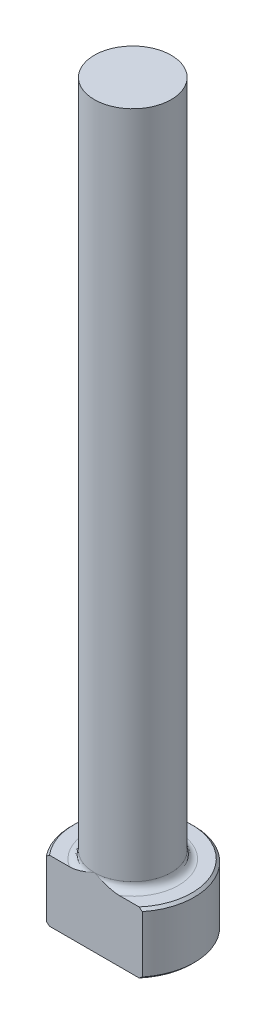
ISO-10303-21;
HEADER;
FILE_DESCRIPTION(('STEP AP214'),'2;1');
FILE_NAME('part.step','',(''),(''),'','','');
FILE_SCHEMA(('AUTOMOTIVE_DESIGN { 1 0 10303 214 1 1 1 1 }'));
ENDSEC;
DATA;
#1=APPLICATION_CONTEXT('core data for automotive mechanical design processes');
#2=APPLICATION_PROTOCOL_DEFINITION('international standard','automotive_design',2000,#1);
#3=PRODUCT_CONTEXT('',#1,'mechanical');
#4=PRODUCT('Part','Part','',(#3));
#5=PRODUCT_RELATED_PRODUCT_CATEGORY('part','',(#4));
#6=PRODUCT_DEFINITION_FORMATION('','',#4);
#7=PRODUCT_DEFINITION_CONTEXT('part definition',#1,'design');
#8=PRODUCT_DEFINITION('design','',#6,#7);
#9=PRODUCT_DEFINITION_SHAPE('','',#8);
#10=(LENGTH_UNIT() NAMED_UNIT(*) SI_UNIT(.MILLI.,.METRE.));
#11=(NAMED_UNIT(*) PLANE_ANGLE_UNIT() SI_UNIT($,.RADIAN.));
#12=(NAMED_UNIT(*) SI_UNIT($,.STERADIAN.) SOLID_ANGLE_UNIT());
#13=UNCERTAINTY_MEASURE_WITH_UNIT(LENGTH_MEASURE(1.E-05),#10,'distance_accuracy_value','');
#14=(GEOMETRIC_REPRESENTATION_CONTEXT(3) GLOBAL_UNCERTAINTY_ASSIGNED_CONTEXT((#13)) GLOBAL_UNIT_ASSIGNED_CONTEXT((#10,
#11,#12)) REPRESENTATION_CONTEXT('',''));
#15=CARTESIAN_POINT('',(0.,0.,0.));
#16=DIRECTION('',(0.,0.,1.));
#17=DIRECTION('',(1.,0.,0.));
#18=AXIS2_PLACEMENT_3D('',#15,#16,#17);
#19=CARTESIAN_POINT('',(0.,0.,0.));
#20=DIRECTION('',(0.,-1.,0.));
#21=DIRECTION('',(0.,0.,-1.));
#22=AXIS2_PLACEMENT_3D('',#19,#20,#21);
#23=PLANE('',#22);
#24=CARTESIAN_POINT('',(0.,0.,0.));
#25=DIRECTION('',(0.,-1.,0.));
#26=DIRECTION('',(0.,0.,-1.));
#27=AXIS2_PLACEMENT_3D('',#24,#25,#26);
#28=CIRCLE('',#27,6.096);
#29=CARTESIAN_POINT('',(-4.6271199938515,0.,3.96874999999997));
#30=VERTEX_POINT('',#29);
#31=CARTESIAN_POINT('',(4.6271199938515,0.,3.96874999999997));
#32=VERTEX_POINT('',#31);
#33=EDGE_CURVE('E98',#30,#32,#28,.T.);
#34=ORIENTED_EDGE('',*,*,#33,.T.);
#35=DIRECTION('',(-1.,0.,0.));
#36=VECTOR('',#35,1.);
#37=CARTESIAN_POINT('',(-4.95696716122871,0.,3.96874999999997));
#38=LINE('',#37,#36);
#39=EDGE_CURVE('E83',#32,#30,#38,.T.);
#40=ORIENTED_EDGE('',*,*,#39,.T.);
#41=EDGE_LOOP('',(#34,#40));
#42=FACE_BOUND('',#41,.T.);
#43=ADVANCED_FACE('F32',(#42),#23,.T.);
#44=CARTESIAN_POINT('',(0.,259.958771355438,0.));
#45=DIRECTION('',(0.,1.,0.));
#46=DIRECTION('',(0.,0.,1.));
#47=AXIS2_PLACEMENT_3D('',#44,#45,#46);
#48=CYLINDRICAL_SURFACE('',#47,6.34999999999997);
#49=CARTESIAN_POINT('',(0.,6.09599999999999,0.));
#50=DIRECTION('',(0.,1.,0.));
#51=DIRECTION('',(0.,0.,1.));
#52=AXIS2_PLACEMENT_3D('',#49,#50,#51);
#53=CIRCLE('',#52,6.34999999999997);
#54=CARTESIAN_POINT('',(-4.95696716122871,6.09599999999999,3.96874999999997));
#55=VERTEX_POINT('',#54);
#56=CARTESIAN_POINT('',(4.95696716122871,6.09599999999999,3.96874999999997));
#57=VERTEX_POINT('',#56);
#58=EDGE_CURVE('E104',#55,#57,#53,.F.);
#59=ORIENTED_EDGE('',*,*,#58,.T.);
#60=DIRECTION('',(0.,-1.,0.));
#61=VECTOR('',#60,1.);
#62=CARTESIAN_POINT('',(4.95696716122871,76.2,3.96874999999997));
#63=LINE('',#62,#61);
#64=CARTESIAN_POINT('',(4.95696716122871,0.253999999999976,3.96874999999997));
#65=VERTEX_POINT('',#64);
#66=EDGE_CURVE('E183',#57,#65,#63,.T.);
#67=ORIENTED_EDGE('',*,*,#66,.T.);
#68=CARTESIAN_POINT('',(0.,0.253999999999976,0.));
#69=DIRECTION('',(0.,-1.,0.));
#70=DIRECTION('',(0.,0.,-1.));
#71=AXIS2_PLACEMENT_3D('',#68,#69,#70);
#72=CIRCLE('',#71,6.34999999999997);
#73=CARTESIAN_POINT('',(-4.95696716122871,0.253999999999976,3.96874999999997));
#74=VERTEX_POINT('',#73);
#75=EDGE_CURVE('E100',#65,#74,#72,.F.);
#76=ORIENTED_EDGE('',*,*,#75,.T.);
#77=DIRECTION('',(0.,-1.,0.));
#78=VECTOR('',#77,1.);
#79=CARTESIAN_POINT('',(-4.95696716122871,76.2,3.96874999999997));
#80=LINE('',#79,#78);
#81=EDGE_CURVE('E93',#55,#74,#80,.T.);
#82=ORIENTED_EDGE('',*,*,#81,.F.);
#83=EDGE_LOOP('',(#59,#67,#76,#82));
#84=FACE_BOUND('',#83,.T.);
#85=ADVANCED_FACE('F158',(#84),#48,.T.);
#86=CARTESIAN_POINT('',(-6.34999999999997,6.35,0.));
#87=DIRECTION('',(0.,1.,0.));
#88=DIRECTION('',(0.,0.,1.));
#89=AXIS2_PLACEMENT_3D('',#86,#87,#88);
#90=PLANE('',#89);
#91=CARTESIAN_POINT('',(0.,6.35,0.));
#92=DIRECTION('',(0.,1.,0.));
#93=DIRECTION('',(0.,0.,1.));
#94=AXIS2_PLACEMENT_3D('',#91,#92,#93);
#95=CIRCLE('',#94,6.09600000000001);
#96=CARTESIAN_POINT('',(4.62711999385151,6.35,3.96874999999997));
#97=VERTEX_POINT('',#96);
#98=CARTESIAN_POINT('',(-4.62711999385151,6.35,3.96874999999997));
#99=VERTEX_POINT('',#98);
#100=EDGE_CURVE('E178',#97,#99,#95,.T.);
#101=ORIENTED_EDGE('',*,*,#100,.T.);
#102=DIRECTION('',(1.,0.,0.));
#103=VECTOR('',#102,1.);
#104=CARTESIAN_POINT('',(-6.34999999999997,6.35,3.96874999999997));
#105=LINE('',#104,#103);
#106=CARTESIAN_POINT('',(-2.57468813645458,6.35000000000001,3.96874999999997));
#107=VERTEX_POINT('',#106);
#108=EDGE_CURVE('E57',#99,#107,#105,.T.);
#109=ORIENTED_EDGE('',*,*,#108,.T.);
#110=CARTESIAN_POINT('',(0.,6.35,0.));
#111=DIRECTION('',(0.,1.,0.));
#112=DIRECTION('',(0.,0.,1.));
#113=AXIS2_PLACEMENT_3D('',#110,#111,#112);
#114=CIRCLE('',#113,4.73074999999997);
#115=CARTESIAN_POINT('',(2.57468813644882,6.35000000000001,3.96874999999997));
#116=VERTEX_POINT('',#115);
#117=EDGE_CURVE('E107',#107,#116,#114,.F.);
#118=ORIENTED_EDGE('',*,*,#117,.T.);
#119=EDGE_CURVE('E136',#116,#97,#105,.T.);
#120=ORIENTED_EDGE('',*,*,#119,.T.);
#121=EDGE_LOOP('',(#101,#109,#118,#120));
#122=FACE_BOUND('',#121,.T.);
#123=ADVANCED_FACE('F147',(#122),#90,.T.);
#124=CARTESIAN_POINT('',(0.,6.35000000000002,0.));
#125=DIRECTION('',(0.,-1.,0.));
#126=DIRECTION('',(0.,0.,-1.));
#127=AXIS2_PLACEMENT_3D('',#124,#125,#126);
#128=CONICAL_SURFACE('',#127,6.09599999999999,0.785398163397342);
#129=ORIENTED_EDGE('',*,*,#58,.F.);
#130=CARTESIAN_POINT('',(-10.9074797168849,0.838929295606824,3.96874999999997));
#131=CARTESIAN_POINT('',(-10.7362098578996,0.999873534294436,3.96874999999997));
#132=CARTESIAN_POINT('',(-10.5647219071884,1.16058556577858,3.96874999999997));
#133=CARTESIAN_POINT('',(-10.2212389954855,1.48146888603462,3.96874999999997));
#134=CARTESIAN_POINT('',(-10.0492440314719,1.64164017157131,3.96874999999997));
#135=CARTESIAN_POINT('',(-9.53215723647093,2.12144657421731,3.96874999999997));
#136=CARTESIAN_POINT('',(-9.18620012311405,2.44015148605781,3.96874999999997));
#137=CARTESIAN_POINT('',(-8.48250908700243,3.08209947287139,3.96874999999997));
#138=CARTESIAN_POINT('',(-8.12469692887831,3.40525689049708,3.96874999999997));
#139=CARTESIAN_POINT('',(-7.40476794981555,4.0463249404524,3.96874999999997));
#140=CARTESIAN_POINT('',(-7.0426538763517,4.36423864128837,3.96874999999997));
#141=CARTESIAN_POINT('',(-6.49464785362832,4.83529502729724,3.96874999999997));
#142=CARTESIAN_POINT('',(-6.31122194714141,4.99130476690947,3.96874999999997));
#143=CARTESIAN_POINT('',(-5.94233504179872,5.3009156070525,3.96874999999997));
#144=CARTESIAN_POINT('',(-5.75687398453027,5.45451663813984,3.96874999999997));
#145=CARTESIAN_POINT('',(-5.38307682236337,5.75894505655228,3.96874999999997));
#146=CARTESIAN_POINT('',(-5.19473578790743,5.90976640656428,3.96874999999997));
#147=CARTESIAN_POINT('',(-4.81490900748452,6.20737957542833,3.96874999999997));
#148=CARTESIAN_POINT('',(-4.6234235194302,6.35417172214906,3.96874999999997));
#149=CARTESIAN_POINT('',(-4.23840402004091,6.64094245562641,3.96874999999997));
#150=CARTESIAN_POINT('',(-4.04491037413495,6.78097497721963,3.96874999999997));
#151=CARTESIAN_POINT('',(-3.65282433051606,7.05394467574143,3.96874999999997));
#152=CARTESIAN_POINT('',(-3.45422994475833,7.1868790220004,3.96874999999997));
#153=CARTESIAN_POINT('',(-3.0513063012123,7.44227984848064,3.96874999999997));
#154=CARTESIAN_POINT('',(-2.84699866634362,7.5647801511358,3.96874999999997));
#155=CARTESIAN_POINT('',(-2.43048905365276,7.79538986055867,3.96874999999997));
#156=CARTESIAN_POINT('',(-2.21829552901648,7.90351413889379,3.96874999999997));
#157=CARTESIAN_POINT('',(-1.88022874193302,8.05571524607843,3.96874999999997));
#158=CARTESIAN_POINT('',(-1.75760714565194,8.10699294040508,3.96874999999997));
#159=CARTESIAN_POINT('',(-1.50924598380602,8.20152084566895,3.96874999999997));
#160=CARTESIAN_POINT('',(-1.38350591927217,8.24476976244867,3.96874999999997));
#161=CARTESIAN_POINT('',(-1.12977963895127,8.32133629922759,3.96874999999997));
#162=CARTESIAN_POINT('',(-1.0018102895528,8.35470906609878,3.96874999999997));
#163=CARTESIAN_POINT('',(-0.743427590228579,8.41019049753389,3.96874999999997));
#164=CARTESIAN_POINT('',(-0.613014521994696,8.43230045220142,3.96874999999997));
#165=CARTESIAN_POINT('',(-0.348820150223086,8.46413643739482,3.96874999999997));
#166=CARTESIAN_POINT('',(-0.215017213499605,8.47368667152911,3.96874999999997));
#167=CARTESIAN_POINT('',(0.0528592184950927,8.4791571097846,3.96874999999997));
#168=CARTESIAN_POINT('',(0.186932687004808,8.47507860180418,3.96874999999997));
#169=CARTESIAN_POINT('',(0.454438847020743,8.45355129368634,3.96874999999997));
#170=CARTESIAN_POINT('',(0.587867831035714,8.43605726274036,3.96874999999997));
#171=CARTESIAN_POINT('',(0.852531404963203,8.38880841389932,3.96874999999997));
#172=CARTESIAN_POINT('',(0.983765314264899,8.35904986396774,3.96874999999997));
#173=CARTESIAN_POINT('',(1.28880023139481,8.27664707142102,3.96874999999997));
#174=CARTESIAN_POINT('',(1.46141329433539,8.2196378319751,3.96874999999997));
#175=CARTESIAN_POINT('',(1.8009000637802,8.09060275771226,3.96874999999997));
#176=CARTESIAN_POINT('',(1.96777052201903,8.01856858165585,3.96874999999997));
#177=CARTESIAN_POINT('',(2.21492486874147,7.90160331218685,3.96874999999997));
#178=CARTESIAN_POINT('',(2.29724213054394,7.86087235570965,3.96874999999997));
#179=CARTESIAN_POINT('',(2.46058693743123,7.77689381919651,3.96874999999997));
#180=CARTESIAN_POINT('',(2.54161446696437,7.73364620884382,3.96874999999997));
#181=CARTESIAN_POINT('',(2.70243717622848,7.6449956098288,3.96874999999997));
#182=CARTESIAN_POINT('',(2.7822328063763,7.5995934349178,3.96874999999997));
#183=CARTESIAN_POINT('',(2.94071403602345,7.50690571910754,3.96874999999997));
#184=CARTESIAN_POINT('',(3.01939969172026,7.45962027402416,3.96874999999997));
#185=CARTESIAN_POINT('',(3.28991241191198,7.29319146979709,3.96874999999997));
#186=CARTESIAN_POINT('',(3.47920753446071,7.16992469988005,3.96874999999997));
#187=CARTESIAN_POINT('',(3.85299575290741,6.91628466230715,3.96874999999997));
#188=CARTESIAN_POINT('',(4.03748740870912,6.78590929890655,3.96874999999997));
#189=CARTESIAN_POINT('',(4.40281517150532,6.51977921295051,3.96874999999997));
#190=CARTESIAN_POINT('',(4.58364746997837,6.3840192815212,3.96874999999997));
#191=CARTESIAN_POINT('',(4.94222498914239,6.10853910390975,3.96874999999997));
#192=CARTESIAN_POINT('',(5.11997054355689,5.9688192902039,3.96874999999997));
#193=CARTESIAN_POINT('',(5.47373559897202,5.68571433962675,3.96874999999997));
#194=CARTESIAN_POINT('',(5.64974474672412,5.54231629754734,3.96874999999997));
#195=CARTESIAN_POINT('',(5.99974206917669,5.2530724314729,3.96874999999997));
#196=CARTESIAN_POINT('',(6.1737301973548,5.10722655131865,3.96874999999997));
#197=CARTESIAN_POINT('',(6.69302814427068,4.66694445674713,3.96874999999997));
#198=CARTESIAN_POINT('',(7.03587209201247,4.36960132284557,3.96874999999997));
#199=CARTESIAN_POINT('',(7.67698172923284,3.80499574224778,3.96874999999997));
#200=CARTESIAN_POINT('',(7.97575257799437,3.53830334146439,3.96874999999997));
#201=CARTESIAN_POINT('',(8.57066794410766,3.00191368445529,3.96874999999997));
#202=CARTESIAN_POINT('',(8.86681204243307,2.73221596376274,3.96874999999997));
#203=CARTESIAN_POINT('',(9.45462121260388,2.19284079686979,3.96874999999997));
#204=CARTESIAN_POINT('',(9.74630307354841,1.92318161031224,3.96874999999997));
#205=CARTESIAN_POINT('',(10.3280138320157,1.38219972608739,3.96874999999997));
#206=CARTESIAN_POINT('',(10.6180430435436,1.11087736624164,3.96874999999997));
#207=CARTESIAN_POINT('',(10.9074797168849,0.838929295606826,3.96874999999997));
#208=B_SPLINE_CURVE_WITH_KNOTS('',3,(#130,#131,#132,#133,#134,#135,#136,#137,#138,#139,#140,
#141,#142,#143,#144,#145,#146,#147,#148,#149,#150,#151,#152,#153,#154,#155,#156,#157,#158,#159,
#160,#161,#162,#163,#164,#165,#166,#167,#168,#169,#170,#171,#172,#173,#174,#175,#176,#177,#178,
#179,#180,#181,#182,#183,#184,#185,#186,#187,#188,#189,#190,#191,#192,#193,#194,#195,#196,#197,
#198,#199,#200,#201,#202,#203,#204,#205,#206,#207),.UNSPECIFIED.,.F.,.F.,(4,2,2,2,2,2,2,2,2,2,2,
2,2,2,2,2,2,2,2,2,2,2,2,2,2,2,2,2,2,2,2,2,2,2,2,2,2,2,4),(0.,0.705072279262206,1.41014876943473,
2.82127665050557,4.26767292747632,5.71319041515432,6.43557153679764,7.15797344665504,
7.88179359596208,8.60555467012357,9.32198841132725,10.0387057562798,10.753003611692,
11.4665567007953,11.8650702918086,12.2636480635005,12.6599563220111,13.0562191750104,
13.457971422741,13.859685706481,14.2627603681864,14.665957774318,15.2103582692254,
15.7550618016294,16.0305566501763,16.3060548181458,16.5814497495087,16.856830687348,
17.5342490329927,18.2118681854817,18.8901596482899,19.5683773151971,20.2494368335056,
20.930511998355,22.2918881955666,23.4933255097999,24.6949511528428,25.8866442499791,
27.0781028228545),.UNSPECIFIED.);
#209=EDGE_CURVE('E135',#55,#99,#208,.T.);
#210=ORIENTED_EDGE('',*,*,#209,.T.);
#211=ORIENTED_EDGE('',*,*,#100,.F.);
#212=EDGE_CURVE('E127',#97,#57,#208,.T.);
#213=ORIENTED_EDGE('',*,*,#212,.T.);
#214=EDGE_LOOP('',(#129,#210,#211,#213));
#215=FACE_BOUND('',#214,.T.);
#216=ADVANCED_FACE('F143',(#215),#128,.T.);
#217=CARTESIAN_POINT('',(0.,0.253999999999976,0.));
#218=DIRECTION('',(0.,1.,0.));
#219=DIRECTION('',(0.,0.,1.));
#220=AXIS2_PLACEMENT_3D('',#217,#218,#219);
#221=CONICAL_SURFACE('',#220,6.34999999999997,0.785398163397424);
#222=ORIENTED_EDGE('',*,*,#75,.F.);
#223=CARTESIAN_POINT('',(10.9074797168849,5.51107070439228,3.96874999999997));
#224=CARTESIAN_POINT('',(10.7362098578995,5.35012646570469,3.96874999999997));
#225=CARTESIAN_POINT('',(10.5647219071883,5.18941443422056,3.96874999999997));
#226=CARTESIAN_POINT('',(10.2212389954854,4.86853111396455,3.96874999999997));
#227=CARTESIAN_POINT('',(10.0492440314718,4.70835982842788,3.96874999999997));
#228=CARTESIAN_POINT('',(9.53215723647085,4.22855342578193,3.96874999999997));
#229=CARTESIAN_POINT('',(9.18620012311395,3.90984851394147,3.96874999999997));
#230=CARTESIAN_POINT('',(8.48250908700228,3.26790052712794,3.96874999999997));
#231=CARTESIAN_POINT('',(8.12469692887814,2.94474310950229,3.96874999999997));
#232=CARTESIAN_POINT('',(7.40476794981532,2.30367505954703,3.96874999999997));
#233=CARTESIAN_POINT('',(7.04265387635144,1.98576135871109,3.96874999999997));
#234=CARTESIAN_POINT('',(6.49464785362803,1.51470497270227,3.96874999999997));
#235=CARTESIAN_POINT('',(6.31122194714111,1.35869523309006,3.96874999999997));
#236=CARTESIAN_POINT('',(5.94233504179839,1.04908439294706,3.96874999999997));
#237=CARTESIAN_POINT('',(5.75687398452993,0.895483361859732,3.96874999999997));
#238=CARTESIAN_POINT('',(5.383076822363,0.591054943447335,3.96874999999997));
#239=CARTESIAN_POINT('',(5.19473578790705,0.440233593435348,3.96874999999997));
#240=CARTESIAN_POINT('',(4.81490900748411,0.142620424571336,3.96874999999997));
#241=CARTESIAN_POINT('',(4.62342351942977,-0.00417172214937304,3.96874999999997));
#242=CARTESIAN_POINT('',(4.23840402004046,-0.290942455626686,3.96874999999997));
#243=CARTESIAN_POINT('',(4.04491037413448,-0.430974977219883,3.96874999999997));
#244=CARTESIAN_POINT('',(3.65282433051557,-0.703944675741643,3.96874999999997));
#245=CARTESIAN_POINT('',(3.45422994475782,-0.836879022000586,3.96874999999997));
#246=CARTESIAN_POINT('',(3.05130630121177,-1.09227984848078,3.96874999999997));
#247=CARTESIAN_POINT('',(2.84699866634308,-1.21478015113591,3.96874999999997));
#248=CARTESIAN_POINT('',(2.43048905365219,-1.44538986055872,3.96874999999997));
#249=CARTESIAN_POINT('',(2.21829552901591,-1.55351413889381,3.96874999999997));
#250=CARTESIAN_POINT('',(1.88022874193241,-1.7057152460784,3.96874999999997));
#251=CARTESIAN_POINT('',(1.75760714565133,-1.75699294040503,3.96874999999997));
#252=CARTESIAN_POINT('',(1.50924598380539,-1.85152084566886,3.96874999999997));
#253=CARTESIAN_POINT('',(1.38350591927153,-1.89476976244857,3.96874999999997));
#254=CARTESIAN_POINT('',(1.12977963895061,-1.97133629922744,3.96874999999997));
#255=CARTESIAN_POINT('',(1.00181028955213,-2.00470906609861,3.96874999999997));
#256=CARTESIAN_POINT('',(0.743427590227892,-2.06019049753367,3.96874999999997));
#257=CARTESIAN_POINT('',(0.613014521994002,-2.08230045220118,3.96874999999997));
#258=CARTESIAN_POINT('',(0.348820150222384,-2.11413643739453,3.96874999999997));
#259=CARTESIAN_POINT('',(0.215017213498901,-2.12368667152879,3.96874999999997));
#260=CARTESIAN_POINT('',(-0.0528592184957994,-2.12915710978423,3.96874999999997));
#261=CARTESIAN_POINT('',(-0.186932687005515,-2.12507860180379,3.96874999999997));
#262=CARTESIAN_POINT('',(-0.454438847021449,-2.10355129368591,3.96874999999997));
#263=CARTESIAN_POINT('',(-0.587867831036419,-2.0860572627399,3.96874999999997));
#264=CARTESIAN_POINT('',(-0.852531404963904,-2.03880841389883,3.96874999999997));
#265=CARTESIAN_POINT('',(-0.983765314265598,-2.00904986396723,3.96874999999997));
#266=CARTESIAN_POINT('',(-1.28880023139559,-1.92664707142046,3.96874999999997));
#267=CARTESIAN_POINT('',(-1.46141329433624,-1.86963783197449,3.96874999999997));
#268=CARTESIAN_POINT('',(-1.8009000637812,-1.74060275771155,3.96874999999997));
#269=CARTESIAN_POINT('',(-1.9677705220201,-1.66856858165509,3.96874999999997));
#270=CARTESIAN_POINT('',(-2.21492486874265,-1.55160331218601,3.96874999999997));
#271=CARTESIAN_POINT('',(-2.29724213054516,-1.51087235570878,3.96874999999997));
#272=CARTESIAN_POINT('',(-2.46058693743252,-1.42689381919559,3.96874999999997));
#273=CARTESIAN_POINT('',(-2.54161446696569,-1.38364620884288,3.96874999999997));
#274=CARTESIAN_POINT('',(-2.70243717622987,-1.2949956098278,3.96874999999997));
#275=CARTESIAN_POINT('',(-2.78223280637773,-1.24959343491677,3.96874999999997));
#276=CARTESIAN_POINT('',(-2.94071403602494,-1.15690571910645,3.96874999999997));
#277=CARTESIAN_POINT('',(-3.01939969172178,-1.10962027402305,3.96874999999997));
#278=CARTESIAN_POINT('',(-3.28991241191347,-0.943191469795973,3.96874999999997));
#279=CARTESIAN_POINT('',(-3.47920753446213,-0.819924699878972,3.96874999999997));
#280=CARTESIAN_POINT('',(-3.85299575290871,-0.566284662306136,3.96874999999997));
#281=CARTESIAN_POINT('',(-4.03748740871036,-0.435909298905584,3.96874999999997));
#282=CARTESIAN_POINT('',(-4.40281517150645,-0.169779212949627,3.96874999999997));
#283=CARTESIAN_POINT('',(-4.58364746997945,-0.0340192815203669,3.96874999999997));
#284=CARTESIAN_POINT('',(-4.94222498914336,0.241460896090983,3.96874999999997));
#285=CARTESIAN_POINT('',(-5.11997054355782,0.381180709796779,3.96874999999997));
#286=CARTESIAN_POINT('',(-5.47373559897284,0.664285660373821,3.96874999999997));
#287=CARTESIAN_POINT('',(-5.64974474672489,0.807683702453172,3.96874999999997));
#288=CARTESIAN_POINT('',(-5.99974206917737,1.09692756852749,3.96874999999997));
#289=CARTESIAN_POINT('',(-6.17373019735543,1.24277344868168,3.96874999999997));
#290=CARTESIAN_POINT('',(-6.69302814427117,1.68305554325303,3.96874999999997));
#291=CARTESIAN_POINT('',(-7.03587209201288,1.98039867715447,3.96874999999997));
#292=CARTESIAN_POINT('',(-7.67698172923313,2.54500425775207,3.96874999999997));
#293=CARTESIAN_POINT('',(-7.97575257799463,2.81169665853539,3.96874999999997));
#294=CARTESIAN_POINT('',(-8.57066794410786,3.34808631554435,3.96874999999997));
#295=CARTESIAN_POINT('',(-8.86681204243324,3.61778403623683,3.96874999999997));
#296=CARTESIAN_POINT('',(-9.45462121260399,4.15715920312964,3.96874999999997));
#297=CARTESIAN_POINT('',(-9.74630307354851,4.42681838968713,3.96874999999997));
#298=CARTESIAN_POINT('',(-10.3280138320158,4.96780027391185,3.96874999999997));
#299=CARTESIAN_POINT('',(-10.6180430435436,5.23912263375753,3.96874999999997));
#300=CARTESIAN_POINT('',(-10.9074797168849,5.51107070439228,3.96874999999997));
#301=B_SPLINE_CURVE_WITH_KNOTS('',3,(#223,#224,#225,#226,#227,#228,#229,#230,#231,#232,#233,
#234,#235,#236,#237,#238,#239,#240,#241,#242,#243,#244,#245,#246,#247,#248,#249,#250,#251,#252,
#253,#254,#255,#256,#257,#258,#259,#260,#261,#262,#263,#264,#265,#266,#267,#268,#269,#270,#271,
#272,#273,#274,#275,#276,#277,#278,#279,#280,#281,#282,#283,#284,#285,#286,#287,#288,#289,#290,
#291,#292,#293,#294,#295,#296,#297,#298,#299,#300),.UNSPECIFIED.,.F.,.F.,(4,2,2,2,2,2,2,2,2,2,2,
2,2,2,2,2,2,2,2,2,2,2,2,2,2,2,2,2,2,2,2,2,2,2,2,2,2,2,4),(0.,0.705072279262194,1.41014876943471,
2.82127665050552,4.26767292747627,5.71319041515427,6.43557153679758,7.15797344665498,
7.88179359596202,8.60555467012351,9.32198841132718,10.0387057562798,10.7530036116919,
11.4665567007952,11.8650702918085,12.2636480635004,12.659956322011,13.0562191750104,
13.4579714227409,13.8596857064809,14.2627603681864,14.6659577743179,15.2103582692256,
15.7550618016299,16.0305566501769,16.3060548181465,16.5814497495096,16.8568306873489,
17.5342490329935,18.2118681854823,18.8901596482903,19.5683773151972,20.2494368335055,
20.9305119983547,22.2918881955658,23.493325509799,24.6949511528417,25.8866442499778,
27.078102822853),.UNSPECIFIED.);
#302=EDGE_CURVE('E86',#65,#32,#301,.T.);
#303=ORIENTED_EDGE('',*,*,#302,.T.);
#304=ORIENTED_EDGE('',*,*,#33,.F.);
#305=EDGE_CURVE('E89',#30,#74,#301,.T.);
#306=ORIENTED_EDGE('',*,*,#305,.T.);
#307=EDGE_LOOP('',(#222,#303,#304,#306));
#308=FACE_BOUND('',#307,.T.);
#309=ADVANCED_FACE('F97',(#308),#221,.T.);
#310=CARTESIAN_POINT('',(0.,7.11200000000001,0.));
#311=DIRECTION('',(0.,1.,0.));
#312=DIRECTION('',(0.,0.,1.));
#313=AXIS2_PLACEMENT_3D('',#310,#311,#312);
#314=TOROIDAL_SURFACE('',#313,4.73074999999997,0.762);
#315=CARTESIAN_POINT('',(0.,7.11200000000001,3.96874999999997));
#316=CARTESIAN_POINT('',(2.72452874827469E-10,7.11200100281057,3.96874999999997));
#317=CARTESIAN_POINT('',(1.89097572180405E-07,7.11200200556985,3.96874999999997));
#318=CARTESIAN_POINT('',(7.99901127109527E-07,7.11200394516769,3.96874999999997));
#319=CARTESIAN_POINT('',(1.2266662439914E-06,7.11200488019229,3.96874999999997));
#320=CARTESIAN_POINT('',(2.25601477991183E-06,7.11200673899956,3.96874999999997));
#321=CARTESIAN_POINT('',(2.86938873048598E-06,7.11200765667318,3.96874999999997));
#322=CARTESIAN_POINT('',(4.2009410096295E-06,7.11200939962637,3.96874999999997));
#323=CARTESIAN_POINT('',(4.91843246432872E-06,7.11201022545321,3.96874999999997));
#324=CARTESIAN_POINT('',(7.4625804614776E-06,7.11201295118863,3.96874999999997));
#325=CARTESIAN_POINT('',(9.42693843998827E-06,7.11201472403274,3.96874999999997));
#326=CARTESIAN_POINT('',(1.35156238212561E-05,7.11201792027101,3.96874999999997));
#327=CARTESIAN_POINT('',(1.56334419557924E-05,7.11201935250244,3.96874999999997));
#328=CARTESIAN_POINT('',(2.37794366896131E-05,7.11202462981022,3.96874999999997));
#329=CARTESIAN_POINT('',(3.00000425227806E-05,7.11202818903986,3.96874999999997));
#330=CARTESIAN_POINT('',(4.23604379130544E-05,7.11203410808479,3.96874999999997));
#331=CARTESIAN_POINT('',(4.84662901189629E-05,7.11203654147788,3.96874999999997));
#332=CARTESIAN_POINT('',(7.41361994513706E-05,7.11204669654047,3.96874999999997));
#333=CARTESIAN_POINT('',(9.37464432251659E-05,7.11205427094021,3.96874999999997));
#334=CARTESIAN_POINT('',(0.000130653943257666,7.11206661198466,3.96874999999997));
#335=CARTESIAN_POINT('',(0.00014786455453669,7.11207162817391,3.96874999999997));
#336=CARTESIAN_POINT('',(0.000271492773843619,7.11211085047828,3.96874999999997));
#337=CARTESIAN_POINT('',(0.000372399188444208,7.11216017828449,3.96874999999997));
#338=CARTESIAN_POINT('',(0.000762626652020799,7.11234384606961,3.96874999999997));
#339=CARTESIAN_POINT('',(0.00105578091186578,7.1124669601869,3.96874999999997));
#340=CARTESIAN_POINT('',(0.00218658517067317,7.11294905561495,3.96874999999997));
#341=CARTESIAN_POINT('',(0.00302029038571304,7.11331980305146,3.96874999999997));
#342=CARTESIAN_POINT('',(0.00641326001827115,7.11482126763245,3.96874999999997));
#343=CARTESIAN_POINT('',(0.00897690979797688,7.1159386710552,3.96874999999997));
#344=CARTESIAN_POINT('',(0.0431521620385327,7.13084393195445,3.96874999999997));
#345=CARTESIAN_POINT('',(0.0747329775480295,7.14472589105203,3.96874999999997));
#346=CARTESIAN_POINT('',(0.138371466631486,7.17259981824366,3.96874999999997));
#347=CARTESIAN_POINT('',(0.170429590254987,7.18659058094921,3.96874999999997));
#348=CARTESIAN_POINT('',(0.263897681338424,7.22728018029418,3.96874999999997));
#349=CARTESIAN_POINT('',(0.32534291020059,7.25390148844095,3.96874999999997));
#350=CARTESIAN_POINT('',(0.45545149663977,7.30966012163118,3.96874999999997));
#351=CARTESIAN_POINT('',(0.524140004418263,7.33873873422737,3.96874999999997));
#352=CARTESIAN_POINT('',(0.662588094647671,7.39626071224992,3.96874999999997));
#353=CARTESIAN_POINT('',(0.732351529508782,7.42469485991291,3.96874999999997));
#354=CARTESIAN_POINT('',(0.854677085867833,7.47322946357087,3.96874999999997));
#355=CARTESIAN_POINT('',(0.907124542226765,7.49361793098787,3.96874999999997));
#356=CARTESIAN_POINT('',(1.01222990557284,7.53345950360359,3.96874999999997));
#357=CARTESIAN_POINT('',(1.06488701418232,7.55291472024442,3.96874999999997));
#358=CARTESIAN_POINT('',(1.22118224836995,7.60890100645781,3.96874999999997));
#359=CARTESIAN_POINT('',(1.32536392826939,7.64394780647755,3.96874999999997));
#360=CARTESIAN_POINT('',(1.51475689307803,7.70222633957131,3.96874999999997));
#361=CARTESIAN_POINT('',(1.59966831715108,7.72642606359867,3.96874999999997));
#362=CARTESIAN_POINT('',(1.77115576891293,7.77055798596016,3.96874999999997));
#363=CARTESIAN_POINT('',(1.85773874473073,7.79046358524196,3.96874999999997));
#364=CARTESIAN_POINT('',(2.03663433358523,7.8256694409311,3.96874999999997));
#365=CARTESIAN_POINT('',(2.12900742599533,7.84066973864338,3.96874999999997));
#366=CARTESIAN_POINT('',(2.31450882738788,7.86300878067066,3.96874999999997));
#367=CARTESIAN_POINT('',(2.40763490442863,7.87036510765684,3.96874999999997));
#368=CARTESIAN_POINT('',(2.58622461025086,7.87533872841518,3.96874999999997));
#369=CARTESIAN_POINT('',(2.67166229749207,7.87373524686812,3.96874999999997));
#370=CARTESIAN_POINT('',(2.84116133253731,7.86073590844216,3.96874999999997));
#371=CARTESIAN_POINT('',(2.92522821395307,7.84942227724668,3.96874999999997));
#372=CARTESIAN_POINT('',(3.09260159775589,7.81445437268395,3.96874999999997));
#373=CARTESIAN_POINT('',(3.17586039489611,7.79056108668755,3.96874999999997));
#374=CARTESIAN_POINT('',(3.33637449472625,7.72711703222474,3.96874999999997));
#375=CARTESIAN_POINT('',(3.41365062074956,7.6876237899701,3.96874999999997));
#376=CARTESIAN_POINT('',(3.51798857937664,7.61566535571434,3.96874999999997));
#377=CARTESIAN_POINT('',(3.55006318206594,7.59045187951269,3.96874999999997));
#378=CARTESIAN_POINT('',(3.6102188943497,7.53557765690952,3.96874999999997));
#379=CARTESIAN_POINT('',(3.63830099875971,7.50591802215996,3.96874999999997));
#380=CARTESIAN_POINT('',(3.68933162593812,7.44181271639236,3.96874999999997));
#381=CARTESIAN_POINT('',(3.7122145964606,7.40731395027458,3.96874999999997));
#382=CARTESIAN_POINT('',(3.75063172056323,7.3344255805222,3.96874999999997));
#383=CARTESIAN_POINT('',(3.76617854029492,7.29604282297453,3.96874999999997));
#384=CARTESIAN_POINT('',(3.7867432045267,7.22260269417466,3.96874999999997));
#385=CARTESIAN_POINT('',(3.79297266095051,7.18788564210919,3.96874999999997));
#386=CARTESIAN_POINT('',(3.79840708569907,7.11791009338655,3.96874999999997));
#387=CARTESIAN_POINT('',(3.79761729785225,7.08265202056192,3.96874999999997));
#388=CARTESIAN_POINT('',(3.7897274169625,7.01808169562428,3.96874999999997));
#389=CARTESIAN_POINT('',(3.78356056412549,6.98864967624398,3.96874999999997));
#390=CARTESIAN_POINT('',(3.76657344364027,6.93117296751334,3.96874999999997));
#391=CARTESIAN_POINT('',(3.75575305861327,6.90312831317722,3.96874999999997));
#392=CARTESIAN_POINT('',(3.72949416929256,6.84779976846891,3.96874999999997));
#393=CARTESIAN_POINT('',(3.713874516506,6.82060268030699,3.96874999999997));
#394=CARTESIAN_POINT('',(3.67898159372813,6.76868386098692,3.96874999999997));
#395=CARTESIAN_POINT('',(3.6597066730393,6.74396325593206,3.96874999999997));
#396=CARTESIAN_POINT('',(3.60698815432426,6.68446341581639,3.96874999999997));
#397=CARTESIAN_POINT('',(3.57151931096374,6.65147423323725,3.96874999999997));
#398=CARTESIAN_POINT('',(3.49575447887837,6.59155388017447,3.96874999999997));
#399=CARTESIAN_POINT('',(3.45544429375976,6.56464122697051,3.96874999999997));
#400=CARTESIAN_POINT('',(3.35110964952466,6.50463027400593,3.96874999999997));
#401=CARTESIAN_POINT('',(3.2851315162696,6.47494717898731,3.96874999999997));
#402=CARTESIAN_POINT('',(3.1496628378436,6.42615277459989,3.96874999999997));
#403=CARTESIAN_POINT('',(3.08017671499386,6.40702850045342,3.96874999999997));
#404=CARTESIAN_POINT('',(2.95179922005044,6.38006601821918,3.96874999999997));
#405=CARTESIAN_POINT('',(2.89318763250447,6.37083647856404,3.96874999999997));
#406=CARTESIAN_POINT('',(2.77536712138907,6.35745547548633,3.96874999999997));
#407=CARTESIAN_POINT('',(2.71615776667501,6.35330798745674,3.96874999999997));
#408=CARTESIAN_POINT('',(2.53632384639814,6.34734840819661,3.96874999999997));
#409=CARTESIAN_POINT('',(2.41545754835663,6.35237783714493,3.96874999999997));
#410=CARTESIAN_POINT('',(2.21811250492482,6.3716785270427,3.96874999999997));
#411=CARTESIAN_POINT('',(2.14116511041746,6.38201761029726,3.96874999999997));
#412=CARTESIAN_POINT('',(1.98802972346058,6.40734893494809,3.96874999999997));
#413=CARTESIAN_POINT('',(1.9118417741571,6.42234143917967,3.96874999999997));
#414=CARTESIAN_POINT('',(1.6839709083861,6.47322550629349,3.96874999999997));
#415=CARTESIAN_POINT('',(1.53360062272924,6.5149500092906,3.96874999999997));
#416=CARTESIAN_POINT('',(1.24863432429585,6.60495823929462,3.96874999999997));
#417=CARTESIAN_POINT('',(1.11376371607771,6.65241192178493,3.96874999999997));
#418=CARTESIAN_POINT('',(0.847576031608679,6.75264930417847,3.96874999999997));
#419=CARTESIAN_POINT('',(0.716236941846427,6.80537521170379,3.96874999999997));
#420=CARTESIAN_POINT('',(0.544659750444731,6.87676192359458,3.96874999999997));
#421=CARTESIAN_POINT('',(0.503794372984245,6.89395286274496,3.96874999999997));
#422=CARTESIAN_POINT('',(0.421123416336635,6.92903262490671,3.96874999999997));
#423=CARTESIAN_POINT('',(0.37932061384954,6.94692803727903,3.96874999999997));
#424=CARTESIAN_POINT('',(0.308934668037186,6.97725002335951,3.96874999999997));
#425=CARTESIAN_POINT('',(0.280329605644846,6.98962609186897,3.96874999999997));
#426=CARTESIAN_POINT('',(0.223423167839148,7.0143301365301,3.96874999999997));
#427=CARTESIAN_POINT('',(0.195121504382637,7.02665744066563,3.96874999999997));
#428=CARTESIAN_POINT('',(0.141398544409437,7.05009288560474,3.96874999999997));
#429=CARTESIAN_POINT('',(0.115975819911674,7.06119805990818,3.96874999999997));
#430=CARTESIAN_POINT('',(0.0642235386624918,7.08387460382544,3.96874999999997));
#431=CARTESIAN_POINT('',(0.0378947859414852,7.09544818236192,3.96874999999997));
#432=CARTESIAN_POINT('',(0.00898087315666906,7.1080596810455,3.96874999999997));
#433=CARTESIAN_POINT('',(0.00642114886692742,7.1091753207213,3.96874999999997));
#434=CARTESIAN_POINT('',(0.00302915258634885,7.11067631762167,3.96874999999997));
#435=CARTESIAN_POINT('',(0.00219250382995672,7.11104837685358,3.96874999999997));
#436=CARTESIAN_POINT('',(0.0010579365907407,7.11153207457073,3.96874999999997));
#437=CARTESIAN_POINT('',(0.000763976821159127,7.11165552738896,3.96874999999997));
#438=CARTESIAN_POINT('',(0.000372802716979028,7.11183964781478,3.96874999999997));
#439=CARTESIAN_POINT('',(0.000271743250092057,7.111889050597,3.96874999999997));
#440=CARTESIAN_POINT('',(0.000147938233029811,7.11192831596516,3.96874999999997));
#441=CARTESIAN_POINT('',(0.000130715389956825,7.11193333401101,3.96874999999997));
#442=CARTESIAN_POINT('',(9.3781335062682E-05,7.11194568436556,3.96874999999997));
#443=CARTESIAN_POINT('',(7.41570977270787E-05,7.11195326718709,3.96874999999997));
#444=CARTESIAN_POINT('',(4.84714569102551E-05,7.11196343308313,3.96874999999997));
#445=CARTESIAN_POINT('',(4.23636191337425E-05,7.11196586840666,3.96874999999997));
#446=CARTESIAN_POINT('',(2.99995408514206E-05,7.11197179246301,3.96874999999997));
#447=CARTESIAN_POINT('',(2.37773032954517E-05,7.11197535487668,3.96874999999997));
#448=CARTESIAN_POINT('',(1.5629804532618E-05,7.11198063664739,3.96874999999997));
#449=CARTESIAN_POINT('',(1.3511828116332E-05,7.11198206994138,3.96874999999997));
#450=CARTESIAN_POINT('',(9.42304071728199E-06,7.11198526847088,3.96874999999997));
#451=CARTESIAN_POINT('',(7.45874783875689E-06,7.11198704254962,3.96874999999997));
#452=CARTESIAN_POINT('',(4.91494695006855E-06,7.11198977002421,3.96874999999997));
#453=CARTESIAN_POINT('',(4.19760643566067E-06,7.11199059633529,3.96874999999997));
#454=CARTESIAN_POINT('',(2.86644232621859E-06,7.11199234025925,3.96874999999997));
#455=CARTESIAN_POINT('',(2.25330635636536E-06,7.11199325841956,3.96874999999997));
#456=CARTESIAN_POINT('',(1.22453499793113E-06,7.11199511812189,3.96874999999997));
#457=CARTESIAN_POINT('',(7.98099013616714E-07,7.11199605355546,3.96874999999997));
#458=CARTESIAN_POINT('',(1.88090826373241E-07,7.11199799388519,3.96874999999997));
#459=CARTESIAN_POINT('',(-2.72512968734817E-10,7.11199899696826,3.96874999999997));
#460=CARTESIAN_POINT('',(0.,7.11200000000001,3.96874999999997));
#461=B_SPLINE_CURVE_WITH_KNOTS('',3,(#315,#316,#317,#318,#319,#320,#321,#322,#323,#324,#325,
#326,#327,#328,#329,#330,#331,#332,#333,#334,#335,#336,#337,#338,#339,#340,#341,#342,#343,#344,
#345,#346,#347,#348,#349,#350,#351,#352,#353,#354,#355,#356,#357,#358,#359,#360,#361,#362,#363,
#364,#365,#366,#367,#368,#369,#370,#371,#372,#373,#374,#375,#376,#377,#378,#379,#380,#381,#382,
#383,#384,#385,#386,#387,#388,#389,#390,#391,#392,#393,#394,#395,#396,#397,#398,#399,#400,#401,
#402,#403,#404,#405,#406,#407,#408,#409,#410,#411,#412,#413,#414,#415,#416,#417,#418,#419,#420,
#421,#422,#423,#424,#425,#426,#427,#428,#429,#430,#431,#432,#433,#434,#435,#436,#437,#438,#439,
#440,#441,#442,#443,#444,#445,#446,#447,#448,#449,#450,#451,#452,#453,#454,#455,#456,#457,#458,
#459,#460),.UNSPECIFIED.,.T.,.F.,(4,2,2,2,2,2,2,2,2,2,2,2,2,2,2,2,2,2,2,2,2,2,2,2,2,2,2,2,2,2,2,
2,2,2,2,2,2,2,2,2,2,2,2,2,2,2,2,2,2,2,2,2,2,2,2,2,2,2,2,2,2,2,2,2,2,2,2,2,2,2,2,2,4),(0.,
3.0057780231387E-06,6.07432687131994E-06,9.37314624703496E-06,1.26511167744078E-05,
2.05502244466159E-05,2.82140028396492E-05,4.9640489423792E-05,6.93390753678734E-05,
0.000132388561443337,0.000186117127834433,0.0005216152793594,0.00147666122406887,
0.00421247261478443,0.0126037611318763,0.116083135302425,0.2210203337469,0.42190992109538,
0.645676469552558,0.871672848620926,1.04047829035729,1.20888182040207,1.53851282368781,
1.80329858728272,2.06968019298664,2.3501784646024,2.63003009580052,2.88594405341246,
3.13971207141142,3.39848556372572,3.65631358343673,3.77836256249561,3.90038107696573,
4.02386182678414,4.14712859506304,4.25227920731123,4.35735127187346,4.44716152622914,
4.53697404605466,4.63071137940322,4.72449114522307,4.86898620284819,5.01391581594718,
5.22974914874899,5.44531687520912,5.62306851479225,5.8009591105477,6.16266479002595,
6.3954713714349,6.62829110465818,7.09579230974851,7.52455372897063,7.94904482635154,
8.08204777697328,8.21846301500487,8.31196587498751,8.40457450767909,8.4878041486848,
8.57407464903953,8.58245304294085,8.58519851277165,8.58615618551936,8.58649219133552,
8.5865459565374,8.58660905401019,8.5866287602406,8.58665019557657,8.58665786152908,
8.58666576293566,8.58666904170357,8.58667234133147,8.58667541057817,8.58667841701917),.UNSPECIFIED.);
#462=CARTESIAN_POINT('',(0.,7.11200000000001,3.96874999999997));
#463=VERTEX_POINT('',#462);
#464=EDGE_CURVE('E11',#116,#463,#461,.T.);
#465=ORIENTED_EDGE('',*,*,#464,.F.);
#466=ORIENTED_EDGE('',*,*,#117,.F.);
#467=CARTESIAN_POINT('',(0.,7.11200000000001,3.96874999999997));
#468=CARTESIAN_POINT('',(-2.72452813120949E-10,7.11199899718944,3.96874999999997));
#469=CARTESIAN_POINT('',(-1.89097572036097E-07,7.11199799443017,3.96874999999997));
#470=CARTESIAN_POINT('',(-7.99901127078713E-07,7.11199605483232,3.96874999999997));
#471=CARTESIAN_POINT('',(-1.22666624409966E-06,7.11199511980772,3.96874999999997));
#472=CARTESIAN_POINT('',(-2.25601477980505E-06,7.11199326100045,3.96874999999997));
#473=CARTESIAN_POINT('',(-2.86938873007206E-06,7.11199234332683,3.96874999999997));
#474=CARTESIAN_POINT('',(-4.20094100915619E-06,7.11199060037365,3.96874999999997));
#475=CARTESIAN_POINT('',(-4.91843246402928E-06,7.1119897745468,3.96874999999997));
#476=CARTESIAN_POINT('',(-7.46258046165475E-06,7.11198704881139,3.96874999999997));
#477=CARTESIAN_POINT('',(-9.42693844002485E-06,7.11198527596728,3.96874999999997));
#478=CARTESIAN_POINT('',(-1.35156238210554E-05,7.11198207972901,3.96874999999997));
#479=CARTESIAN_POINT('',(-1.56334419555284E-05,7.11198064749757,3.96874999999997));
#480=CARTESIAN_POINT('',(-2.3779436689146E-05,7.11197537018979,3.96874999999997));
#481=CARTESIAN_POINT('',(-3.00000425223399E-05,7.11197181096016,3.96874999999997));
#482=CARTESIAN_POINT('',(-4.23604379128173E-05,7.11196589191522,3.96874999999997));
#483=CARTESIAN_POINT('',(-4.84662901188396E-05,7.11196345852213,3.96874999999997));
#484=CARTESIAN_POINT('',(-7.41361994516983E-05,7.11195330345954,3.96874999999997));
#485=CARTESIAN_POINT('',(-9.37464432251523E-05,7.11194572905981,3.96874999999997));
#486=CARTESIAN_POINT('',(-0.000130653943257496,7.11193338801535,3.96874999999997));
#487=CARTESIAN_POINT('',(-0.000147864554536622,7.1119283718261,3.96874999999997));
#488=CARTESIAN_POINT('',(-0.00027149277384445,7.11188914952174,3.96874999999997));
#489=CARTESIAN_POINT('',(-0.000372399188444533,7.11183982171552,3.96874999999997));
#490=CARTESIAN_POINT('',(-0.000762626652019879,7.1116561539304,3.96874999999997));
#491=CARTESIAN_POINT('',(-0.00105578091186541,7.11153303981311,3.96874999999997));
#492=CARTESIAN_POINT('',(-0.00218658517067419,7.11105094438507,3.96874999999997));
#493=CARTESIAN_POINT('',(-0.00302029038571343,7.11068019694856,3.96874999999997));
#494=CARTESIAN_POINT('',(-0.00641326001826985,7.10917873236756,3.96874999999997));
#495=CARTESIAN_POINT('',(-0.00897690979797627,7.10806132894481,3.96874999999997));
#496=CARTESIAN_POINT('',(-0.0431521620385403,7.09315606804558,3.96874999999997));
#497=CARTESIAN_POINT('',(-0.074732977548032,7.07927410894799,3.96874999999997));
#498=CARTESIAN_POINT('',(-0.138371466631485,7.05140018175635,3.96874999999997));
#499=CARTESIAN_POINT('',(-0.170429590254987,7.0374094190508,3.96874999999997));
#500=CARTESIAN_POINT('',(-0.263897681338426,6.99671981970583,3.96874999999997));
#501=CARTESIAN_POINT('',(-0.325342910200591,6.97009851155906,3.96874999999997));
#502=CARTESIAN_POINT('',(-0.455451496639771,6.91433987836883,3.96874999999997));
#503=CARTESIAN_POINT('',(-0.524140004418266,6.88526126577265,3.96874999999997));
#504=CARTESIAN_POINT('',(-0.662588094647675,6.82773928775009,3.96874999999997));
#505=CARTESIAN_POINT('',(-0.732351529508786,6.7993051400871,3.96874999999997));
#506=CARTESIAN_POINT('',(-0.854677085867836,6.75077053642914,3.96874999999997));
#507=CARTESIAN_POINT('',(-0.907124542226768,6.73038206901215,3.96874999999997));
#508=CARTESIAN_POINT('',(-1.01222990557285,6.69054049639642,3.96874999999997));
#509=CARTESIAN_POINT('',(-1.06488701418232,6.6710852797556,3.96874999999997));
#510=CARTESIAN_POINT('',(-1.22118224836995,6.61509899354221,3.96874999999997));
#511=CARTESIAN_POINT('',(-1.32536392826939,6.58005219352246,3.96874999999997));
#512=CARTESIAN_POINT('',(-1.51475689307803,6.52177366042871,3.96874999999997));
#513=CARTESIAN_POINT('',(-1.59966831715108,6.49757393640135,3.96874999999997));
#514=CARTESIAN_POINT('',(-1.77115576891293,6.45344201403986,3.96874999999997));
#515=CARTESIAN_POINT('',(-1.85773874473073,6.43353641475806,3.96874999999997));
#516=CARTESIAN_POINT('',(-2.03663433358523,6.39833055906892,3.96874999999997));
#517=CARTESIAN_POINT('',(-2.12900742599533,6.38333026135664,3.96874999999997));
#518=CARTESIAN_POINT('',(-2.31450882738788,6.36099121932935,3.96874999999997));
#519=CARTESIAN_POINT('',(-2.40763490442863,6.35363489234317,3.96874999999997));
#520=CARTESIAN_POINT('',(-2.58622461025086,6.34866127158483,3.96874999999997));
#521=CARTESIAN_POINT('',(-2.67166229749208,6.3502647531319,3.96874999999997));
#522=CARTESIAN_POINT('',(-2.84116133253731,6.36326409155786,3.96874999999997));
#523=CARTESIAN_POINT('',(-2.92522821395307,6.37457772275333,3.96874999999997));
#524=CARTESIAN_POINT('',(-3.09260159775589,6.40954562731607,3.96874999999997));
#525=CARTESIAN_POINT('',(-3.17586039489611,6.43343891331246,3.96874999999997));
#526=CARTESIAN_POINT('',(-3.33637449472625,6.49688296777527,3.96874999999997));
#527=CARTESIAN_POINT('',(-3.41365062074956,6.53637621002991,3.96874999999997));
#528=CARTESIAN_POINT('',(-3.51798857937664,6.60833464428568,3.96874999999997));
#529=CARTESIAN_POINT('',(-3.55006318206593,6.63354812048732,3.96874999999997));
#530=CARTESIAN_POINT('',(-3.6102188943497,6.68842234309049,3.96874999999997));
#531=CARTESIAN_POINT('',(-3.63830099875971,6.71808197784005,3.96874999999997));
#532=CARTESIAN_POINT('',(-3.68933162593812,6.78218728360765,3.96874999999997));
#533=CARTESIAN_POINT('',(-3.7122145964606,6.81668604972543,3.96874999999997));
#534=CARTESIAN_POINT('',(-3.75063172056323,6.88957441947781,3.96874999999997));
#535=CARTESIAN_POINT('',(-3.76617854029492,6.92795717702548,3.96874999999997));
#536=CARTESIAN_POINT('',(-3.7867432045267,7.00139730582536,3.96874999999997));
#537=CARTESIAN_POINT('',(-3.79297266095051,7.03611435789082,3.96874999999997));
#538=CARTESIAN_POINT('',(-3.79840708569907,7.10608990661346,3.96874999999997));
#539=CARTESIAN_POINT('',(-3.79761729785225,7.14134797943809,3.96874999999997));
#540=CARTESIAN_POINT('',(-3.7897274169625,7.20591830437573,3.96874999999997));
#541=CARTESIAN_POINT('',(-3.78356056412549,7.23535032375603,3.96874999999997));
#542=CARTESIAN_POINT('',(-3.76657344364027,7.29282703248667,3.96874999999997));
#543=CARTESIAN_POINT('',(-3.75575305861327,7.32087168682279,3.96874999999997));
#544=CARTESIAN_POINT('',(-3.72949416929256,7.37620023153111,3.96874999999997));
#545=CARTESIAN_POINT('',(-3.713874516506,7.40339731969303,3.96874999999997));
#546=CARTESIAN_POINT('',(-3.67898159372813,7.45531613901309,3.96874999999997));
#547=CARTESIAN_POINT('',(-3.6597066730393,7.48003674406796,3.96874999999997));
#548=CARTESIAN_POINT('',(-3.60698815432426,7.53953658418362,3.96874999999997));
#549=CARTESIAN_POINT('',(-3.57151931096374,7.57252576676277,3.96874999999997));
#550=CARTESIAN_POINT('',(-3.49575447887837,7.63244611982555,3.96874999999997));
#551=CARTESIAN_POINT('',(-3.45544429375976,7.65935877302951,3.96874999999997));
#552=CARTESIAN_POINT('',(-3.35110964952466,7.71936972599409,3.96874999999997));
#553=CARTESIAN_POINT('',(-3.2851315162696,7.74905282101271,3.96874999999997));
#554=CARTESIAN_POINT('',(-3.1496628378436,7.79784722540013,3.96874999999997));
#555=CARTESIAN_POINT('',(-3.08017671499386,7.8169714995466,3.96874999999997));
#556=CARTESIAN_POINT('',(-2.95179922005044,7.84393398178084,3.96874999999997));
#557=CARTESIAN_POINT('',(-2.89318763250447,7.85316352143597,3.96874999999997));
#558=CARTESIAN_POINT('',(-2.77536712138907,7.86654452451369,3.96874999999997));
#559=CARTESIAN_POINT('',(-2.71615776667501,7.87069201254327,3.96874999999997));
#560=CARTESIAN_POINT('',(-2.53632384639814,7.87665159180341,3.96874999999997));
#561=CARTESIAN_POINT('',(-2.41545754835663,7.87162216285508,3.96874999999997));
#562=CARTESIAN_POINT('',(-2.21811250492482,7.85232147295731,3.96874999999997));
#563=CARTESIAN_POINT('',(-2.14116511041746,7.84198238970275,3.96874999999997));
#564=CARTESIAN_POINT('',(-1.98802972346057,7.81665106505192,3.96874999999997));
#565=CARTESIAN_POINT('',(-1.9118417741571,7.80165856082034,3.96874999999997));
#566=CARTESIAN_POINT('',(-1.68397090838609,7.75077449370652,3.96874999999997));
#567=CARTESIAN_POINT('',(-1.53360062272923,7.70904999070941,3.96874999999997));
#568=CARTESIAN_POINT('',(-1.24863432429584,7.61904176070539,3.96874999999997));
#569=CARTESIAN_POINT('',(-1.1137637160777,7.57158807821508,3.96874999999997));
#570=CARTESIAN_POINT('',(-0.84757603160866,7.47135069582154,3.96874999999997));
#571=CARTESIAN_POINT('',(-0.716236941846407,7.41862478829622,3.96874999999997));
#572=CARTESIAN_POINT('',(-0.544659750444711,7.34723807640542,3.96874999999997));
#573=CARTESIAN_POINT('',(-0.503794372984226,7.33004713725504,3.96874999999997));
#574=CARTESIAN_POINT('',(-0.421123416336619,7.29496737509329,3.96874999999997));
#575=CARTESIAN_POINT('',(-0.379320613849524,7.27707196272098,3.96874999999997));
#576=CARTESIAN_POINT('',(-0.308934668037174,7.2467499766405,3.96874999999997));
#577=CARTESIAN_POINT('',(-0.280329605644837,7.23437390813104,3.96874999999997));
#578=CARTESIAN_POINT('',(-0.223423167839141,7.20966986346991,3.96874999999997));
#579=CARTESIAN_POINT('',(-0.19512150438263,7.19734255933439,3.96874999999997));
#580=CARTESIAN_POINT('',(-0.141398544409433,7.17390711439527,3.96874999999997));
#581=CARTESIAN_POINT('',(-0.115975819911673,7.16280194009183,3.96874999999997));
#582=CARTESIAN_POINT('',(-0.0642235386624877,7.14012539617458,3.96874999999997));
#583=CARTESIAN_POINT('',(-0.0378947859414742,7.12855181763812,3.96874999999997));
#584=CARTESIAN_POINT('',(-0.00898087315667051,7.11594031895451,3.96874999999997));
#585=CARTESIAN_POINT('',(-0.00642114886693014,7.11482467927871,3.96874999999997));
#586=CARTESIAN_POINT('',(-0.00302915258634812,7.11332368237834,3.96874999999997));
#587=CARTESIAN_POINT('',(-0.00219250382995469,7.11295162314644,3.96874999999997));
#588=CARTESIAN_POINT('',(-0.00105793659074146,7.11246792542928,3.96874999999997));
#589=CARTESIAN_POINT('',(-0.000763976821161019,7.11234447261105,3.96874999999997));
#590=CARTESIAN_POINT('',(-0.000372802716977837,7.11216035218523,3.96874999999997));
#591=CARTESIAN_POINT('',(-0.000271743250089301,7.11211094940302,3.96874999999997));
#592=CARTESIAN_POINT('',(-0.000147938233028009,7.11207168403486,3.96874999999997));
#593=CARTESIAN_POINT('',(-0.000130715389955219,7.11206666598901,3.96874999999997));
#594=CARTESIAN_POINT('',(-9.37813350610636E-05,7.11205431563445,3.96874999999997));
#595=CARTESIAN_POINT('',(-7.41570977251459E-05,7.11204673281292,3.96874999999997));
#596=CARTESIAN_POINT('',(-4.847145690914E-05,7.11203656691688,3.96874999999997));
#597=CARTESIAN_POINT('',(-4.23636191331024E-05,7.11203413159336,3.96874999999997));
#598=CARTESIAN_POINT('',(-2.99995408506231E-05,7.112028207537,3.96874999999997));
#599=CARTESIAN_POINT('',(-2.377730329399E-05,7.11202464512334,3.96874999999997));
#600=CARTESIAN_POINT('',(-1.56298045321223E-05,7.11201936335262,3.96874999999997));
#601=CARTESIAN_POINT('',(-1.35118281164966E-05,7.11201793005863,3.96874999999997));
#602=CARTESIAN_POINT('',(-9.4230407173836E-06,7.11201473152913,3.96874999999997));
#603=CARTESIAN_POINT('',(-7.45874783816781E-06,7.1120129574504,3.96874999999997));
#604=CARTESIAN_POINT('',(-4.91494694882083E-06,7.11201022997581,3.96874999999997));
#605=CARTESIAN_POINT('',(-4.19760643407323E-06,7.11200940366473,3.96874999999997));
#606=CARTESIAN_POINT('',(-2.86644232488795E-06,7.11200765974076,3.96874999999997));
#607=CARTESIAN_POINT('',(-2.25330635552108E-06,7.11200674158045,3.96874999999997));
#608=CARTESIAN_POINT('',(-1.22453499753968E-06,7.11200488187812,3.96874999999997));
#609=CARTESIAN_POINT('',(-7.98099013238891E-07,7.11200394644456,3.96874999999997));
#610=CARTESIAN_POINT('',(-1.88090826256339E-07,7.11200200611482,3.96874999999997));
#611=CARTESIAN_POINT('',(2.72512906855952E-10,7.11200100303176,3.96874999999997));
#612=CARTESIAN_POINT('',(0.,7.11200000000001,3.96874999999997));
#613=B_SPLINE_CURVE_WITH_KNOTS('',3,(#467,#468,#469,#470,#471,#472,#473,#474,#475,#476,#477,
#478,#479,#480,#481,#482,#483,#484,#485,#486,#487,#488,#489,#490,#491,#492,#493,#494,#495,#496,
#497,#498,#499,#500,#501,#502,#503,#504,#505,#506,#507,#508,#509,#510,#511,#512,#513,#514,#515,
#516,#517,#518,#519,#520,#521,#522,#523,#524,#525,#526,#527,#528,#529,#530,#531,#532,#533,#534,
#535,#536,#537,#538,#539,#540,#541,#542,#543,#544,#545,#546,#547,#548,#549,#550,#551,#552,#553,
#554,#555,#556,#557,#558,#559,#560,#561,#562,#563,#564,#565,#566,#567,#568,#569,#570,#571,#572,
#573,#574,#575,#576,#577,#578,#579,#580,#581,#582,#583,#584,#585,#586,#587,#588,#589,#590,#591,
#592,#593,#594,#595,#596,#597,#598,#599,#600,#601,#602,#603,#604,#605,#606,#607,#608,#609,#610,
#611,#612),.UNSPECIFIED.,.T.,.F.,(4,2,2,2,2,2,2,2,2,2,2,2,2,2,2,2,2,2,2,2,2,2,2,2,2,2,2,2,2,2,2,
2,2,2,2,2,2,2,2,2,2,2,2,2,2,2,2,2,2,2,2,2,2,2,2,2,2,2,2,2,2,2,2,2,2,2,2,2,2,2,2,2,4),(0.,
3.00577802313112E-06,6.07432687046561E-06,9.37314624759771E-06,1.26511167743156E-05,
2.05502244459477E-05,2.82140028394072E-05,4.9640489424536E-05,6.93390753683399E-05,
0.000132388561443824,0.00018611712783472,0.000521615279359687,0.00147666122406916,
0.00421247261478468,0.0126037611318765,0.116083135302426,0.221020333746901,0.421909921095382,
0.645676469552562,0.87167284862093,1.04047829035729,1.20888182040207,1.53851282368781,
1.80329858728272,2.06968019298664,2.3501784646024,2.63003009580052,2.88594405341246,
3.13971207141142,3.39848556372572,3.65631358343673,3.77836256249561,3.90038107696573,
4.02386182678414,4.14712859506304,4.25227920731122,4.35735127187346,4.44716152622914,
4.53697404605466,4.63071137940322,4.72449114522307,4.8689862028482,5.01391581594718,
5.229749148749,5.44531687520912,5.62306851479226,5.8009591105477,6.16266479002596,
6.3954713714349,6.62829110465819,7.09579230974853,7.52455372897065,7.94904482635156,
8.0820477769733,8.21846301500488,8.31196587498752,8.4045745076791,8.4878041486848,
8.57407464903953,8.58245304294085,8.58519851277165,8.58615618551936,8.58649219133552,
8.5865459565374,8.58660905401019,8.5866287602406,8.58665019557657,8.58665786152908,
8.58666576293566,8.58666904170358,8.58667234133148,8.58667541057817,8.58667841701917),.UNSPECIFIED.);
#614=EDGE_CURVE('E46',#463,#107,#613,.T.);
#615=ORIENTED_EDGE('',*,*,#614,.F.);
#616=CARTESIAN_POINT('',(0.,7.11200000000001,0.));
#617=DIRECTION('',(0.,1.,0.));
#618=DIRECTION('',(0.,0.,1.));
#619=AXIS2_PLACEMENT_3D('',#616,#617,#618);
#620=CIRCLE('',#619,3.96874999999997);
#621=EDGE_CURVE('E103',#463,#463,#620,.T.);
#622=ORIENTED_EDGE('',*,*,#621,.F.);
#623=EDGE_LOOP('',(#465,#466,#615,#622));
#624=FACE_BOUND('',#623,.T.);
#625=ADVANCED_FACE('F34',(#624),#314,.F.);
#626=CARTESIAN_POINT('',(0.,259.958771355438,0.));
#627=DIRECTION('',(0.,1.,0.));
#628=DIRECTION('',(0.,0.,1.));
#629=AXIS2_PLACEMENT_3D('',#626,#627,#628);
#630=CYLINDRICAL_SURFACE('',#629,3.96874999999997);
#631=ORIENTED_EDGE('',*,*,#621,.T.);
#632=EDGE_LOOP('',(#631));
#633=FACE_BOUND('',#632,.T.);
#634=CARTESIAN_POINT('',(0.,76.2,0.));
#635=DIRECTION('',(0.,1.,0.));
#636=DIRECTION('',(0.,0.,1.));
#637=AXIS2_PLACEMENT_3D('',#634,#635,#636);
#638=CIRCLE('',#637,3.96874999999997);
#639=CARTESIAN_POINT('',(0.,76.2,3.96874999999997));
#640=VERTEX_POINT('',#639);
#641=EDGE_CURVE('E101',#640,#640,#638,.T.);
#642=ORIENTED_EDGE('',*,*,#641,.F.);
#643=EDGE_LOOP('',(#642));
#644=FACE_BOUND('',#643,.T.);
#645=ADVANCED_FACE('F155',(#633,#644),#630,.T.);
#646=CARTESIAN_POINT('',(-3.96874999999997,76.2,0.));
#647=DIRECTION('',(0.,1.,0.));
#648=DIRECTION('',(0.,0.,1.));
#649=AXIS2_PLACEMENT_3D('',#646,#647,#648);
#650=PLANE('',#649);
#651=ORIENTED_EDGE('',*,*,#641,.T.);
#652=EDGE_LOOP('',(#651));
#653=FACE_BOUND('',#652,.T.);
#654=ADVANCED_FACE('F121',(#653),#650,.T.);
#655=CARTESIAN_POINT('',(-4.95696716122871,76.2,3.96874999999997));
#656=DIRECTION('',(0.,0.,1.));
#657=DIRECTION('',(1.,0.,0.));
#658=AXIS2_PLACEMENT_3D('',#655,#656,#657);
#659=PLANE('',#658);
#660=ORIENTED_EDGE('',*,*,#66,.F.);
#661=ORIENTED_EDGE('',*,*,#212,.F.);
#662=ORIENTED_EDGE('',*,*,#119,.F.);
#663=ORIENTED_EDGE('',*,*,#464,.T.);
#664=ORIENTED_EDGE('',*,*,#614,.T.);
#665=ORIENTED_EDGE('',*,*,#108,.F.);
#666=ORIENTED_EDGE('',*,*,#209,.F.);
#667=ORIENTED_EDGE('',*,*,#81,.T.);
#668=ORIENTED_EDGE('',*,*,#305,.F.);
#669=ORIENTED_EDGE('',*,*,#39,.F.);
#670=ORIENTED_EDGE('',*,*,#302,.F.);
#671=EDGE_LOOP('',(#660,#661,#662,#663,#664,#665,#666,#667,#668,#669,#670));
#672=FACE_BOUND('',#671,.T.);
#673=ADVANCED_FACE('F85',(#672),#659,.T.);
#674=CLOSED_SHELL('',(#43,#85,#123,#216,#309,#625,#645,#654,#673));
#675=MANIFOLD_SOLID_BREP('B2',#674);
#676=ADVANCED_BREP_SHAPE_REPRESENTATION('',(#18,#675),#14);
#677=SHAPE_DEFINITION_REPRESENTATION(#9,#676);
ENDSEC;
END-ISO-10303-21;
